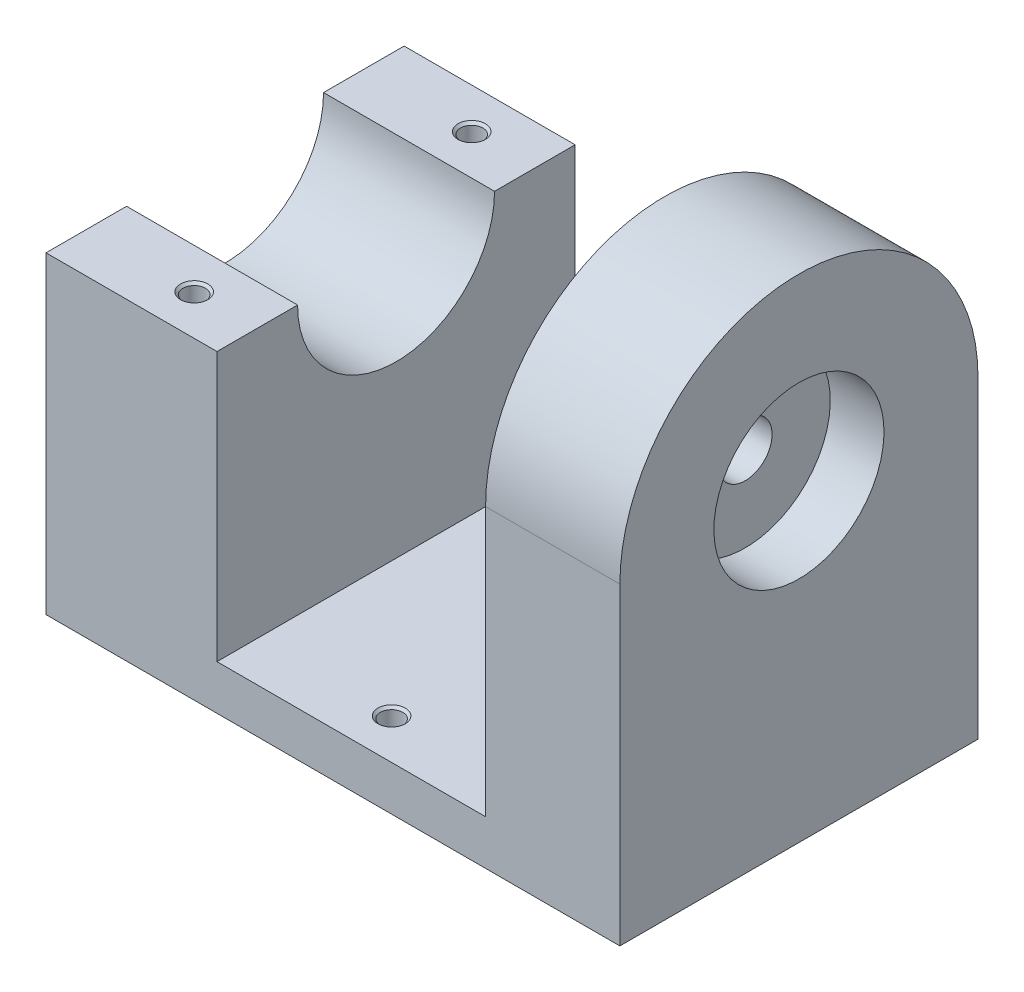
ISO-10303-21;
HEADER;
FILE_DESCRIPTION(('STEP AP214'),'2;1');
FILE_NAME('part.step','',(''),(''),'','','');
FILE_SCHEMA(('AUTOMOTIVE_DESIGN { 1 0 10303 214 1 1 1 1 }'));
ENDSEC;
DATA;
#1=APPLICATION_CONTEXT('core data for automotive mechanical design processes');
#2=APPLICATION_PROTOCOL_DEFINITION('international standard','automotive_design',2000,#1);
#3=PRODUCT_CONTEXT('',#1,'mechanical');
#4=PRODUCT('Part','Part','',(#3));
#5=PRODUCT_RELATED_PRODUCT_CATEGORY('part','',(#4));
#6=PRODUCT_DEFINITION_FORMATION('','',#4);
#7=PRODUCT_DEFINITION_CONTEXT('part definition',#1,'design');
#8=PRODUCT_DEFINITION('design','',#6,#7);
#9=PRODUCT_DEFINITION_SHAPE('','',#8);
#10=(LENGTH_UNIT() NAMED_UNIT(*) SI_UNIT(.MILLI.,.METRE.));
#11=(NAMED_UNIT(*) PLANE_ANGLE_UNIT() SI_UNIT($,.RADIAN.));
#12=(NAMED_UNIT(*) SI_UNIT($,.STERADIAN.) SOLID_ANGLE_UNIT());
#13=UNCERTAINTY_MEASURE_WITH_UNIT(LENGTH_MEASURE(1.E-05),#10,'distance_accuracy_value','');
#14=(GEOMETRIC_REPRESENTATION_CONTEXT(3) GLOBAL_UNCERTAINTY_ASSIGNED_CONTEXT((#13)) GLOBAL_UNIT_ASSIGNED_CONTEXT((#10,
#11,#12)) REPRESENTATION_CONTEXT('',''));
#15=CARTESIAN_POINT('',(0.,0.,0.));
#16=DIRECTION('',(0.,0.,1.));
#17=DIRECTION('',(1.,0.,0.));
#18=AXIS2_PLACEMENT_3D('',#15,#16,#17);
#19=CARTESIAN_POINT('',(-32.05,35.,40.));
#20=DIRECTION('',(0.,-1.,0.));
#21=DIRECTION('',(0.,0.,-1.));
#22=AXIS2_PLACEMENT_3D('',#19,#20,#21);
#23=PLANE('',#22);
#24=CARTESIAN_POINT('',(-20.,35.,35.5));
#25=DIRECTION('',(0.,1.,0.));
#26=DIRECTION('',(0.,0.,1.));
#27=AXIS2_PLACEMENT_3D('',#24,#25,#26);
#28=CIRCLE('',#27,1.525);
#29=CARTESIAN_POINT('',(-20.,35.,37.025));
#30=VERTEX_POINT('',#29);
#31=EDGE_CURVE('E259',#30,#30,#28,.T.);
#32=ORIENTED_EDGE('',*,*,#31,.F.);
#33=EDGE_LOOP('',(#32));
#34=FACE_BOUND('',#33,.T.);
#35=DIRECTION('',(0.,0.,-1.));
#36=VECTOR('',#35,1.);
#37=CARTESIAN_POINT('',(-12.95,35.,40.));
#38=LINE('',#37,#36);
#39=CARTESIAN_POINT('',(-12.95,35.,40.));
#40=VERTEX_POINT('',#39);
#41=CARTESIAN_POINT('',(-12.95,35.,31.));
#42=VERTEX_POINT('',#41);
#43=EDGE_CURVE('E171',#40,#42,#38,.T.);
#44=ORIENTED_EDGE('',*,*,#43,.T.);
#45=DIRECTION('',(-1.,0.,0.));
#46=VECTOR('',#45,1.);
#47=CARTESIAN_POINT('',(-2.05,35.,31.));
#48=LINE('',#47,#46);
#49=CARTESIAN_POINT('',(-32.05,35.,31.));
#50=VERTEX_POINT('',#49);
#51=EDGE_CURVE('E138',#42,#50,#48,.T.);
#52=ORIENTED_EDGE('',*,*,#51,.T.);
#53=DIRECTION('',(0.,0.,-1.));
#54=VECTOR('',#53,1.);
#55=CARTESIAN_POINT('',(-32.05,35.,40.));
#56=LINE('',#55,#54);
#57=CARTESIAN_POINT('',(-32.05,35.,40.));
#58=VERTEX_POINT('',#57);
#59=EDGE_CURVE('E135',#58,#50,#56,.T.);
#60=ORIENTED_EDGE('',*,*,#59,.F.);
#61=DIRECTION('',(-1.,0.,0.));
#62=VECTOR('',#61,1.);
#63=CARTESIAN_POINT('',(-32.05,35.,40.));
#64=LINE('',#63,#62);
#65=EDGE_CURVE('E121',#40,#58,#64,.T.);
#66=ORIENTED_EDGE('',*,*,#65,.F.);
#67=EDGE_LOOP('',(#44,#52,#60,#66));
#68=FACE_BOUND('',#67,.T.);
#69=ADVANCED_FACE('F44',(#34,#68),#23,.F.);
#70=CARTESIAN_POINT('',(32.05,0.,40.));
#71=DIRECTION('',(-1.,0.,0.));
#72=DIRECTION('',(0.,0.,1.));
#73=AXIS2_PLACEMENT_3D('',#70,#71,#72);
#74=PLANE('',#73);
#75=CARTESIAN_POINT('',(32.05,35.,20.));
#76=DIRECTION('',(1.,0.,0.));
#77=DIRECTION('',(0.,1.,0.));
#78=AXIS2_PLACEMENT_3D('',#75,#76,#77);
#79=CIRCLE('',#78,9.5);
#80=CARTESIAN_POINT('',(32.05,44.5,20.));
#81=VERTEX_POINT('',#80);
#82=EDGE_CURVE('E180',#81,#81,#79,.T.);
#83=ORIENTED_EDGE('',*,*,#82,.F.);
#84=EDGE_LOOP('',(#83));
#85=FACE_BOUND('',#84,.T.);
#86=DIRECTION('',(0.,1.,0.));
#87=VECTOR('',#86,1.);
#88=CARTESIAN_POINT('',(32.05,0.,0.));
#89=LINE('',#88,#87);
#90=CARTESIAN_POINT('',(32.05,0.,0.));
#91=VERTEX_POINT('',#90);
#92=CARTESIAN_POINT('',(32.05,35.,0.));
#93=VERTEX_POINT('',#92);
#94=EDGE_CURVE('E150',#91,#93,#89,.T.);
#95=ORIENTED_EDGE('',*,*,#94,.T.);
#96=CARTESIAN_POINT('',(32.05,35.,20.));
#97=DIRECTION('',(1.,0.,0.));
#98=DIRECTION('',(0.,1.,0.));
#99=AXIS2_PLACEMENT_3D('',#96,#97,#98);
#100=CIRCLE('',#99,20.);
#101=CARTESIAN_POINT('',(32.05,35.,40.));
#102=VERTEX_POINT('',#101);
#103=EDGE_CURVE('E207',#93,#102,#100,.T.);
#104=ORIENTED_EDGE('',*,*,#103,.T.);
#105=DIRECTION('',(0.,1.,0.));
#106=VECTOR('',#105,1.);
#107=CARTESIAN_POINT('',(32.05,0.,40.));
#108=LINE('',#107,#106);
#109=CARTESIAN_POINT('',(32.05,0.,40.));
#110=VERTEX_POINT('',#109);
#111=EDGE_CURVE('E105',#110,#102,#108,.T.);
#112=ORIENTED_EDGE('',*,*,#111,.F.);
#113=DIRECTION('',(0.,0.,-1.));
#114=VECTOR('',#113,1.);
#115=CARTESIAN_POINT('',(32.05,0.,40.));
#116=LINE('',#115,#114);
#117=EDGE_CURVE('E146',#110,#91,#116,.T.);
#118=ORIENTED_EDGE('',*,*,#117,.T.);
#119=EDGE_LOOP('',(#95,#104,#112,#118));
#120=FACE_BOUND('',#119,.T.);
#121=ADVANCED_FACE('F46',(#85,#120),#74,.F.);
#122=CARTESIAN_POINT('',(17.05,35.,40.));
#123=DIRECTION('',(1.,0.,0.));
#124=DIRECTION('',(0.,1.,0.));
#125=AXIS2_PLACEMENT_3D('',#122,#123,#124);
#126=PLANE('',#125);
#127=CARTESIAN_POINT('',(17.05,35.,20.));
#128=DIRECTION('',(-1.,0.,0.));
#129=DIRECTION('',(0.,-1.,0.));
#130=AXIS2_PLACEMENT_3D('',#127,#128,#129);
#131=CIRCLE('',#130,9.5);
#132=CARTESIAN_POINT('',(17.05,25.5,20.));
#133=VERTEX_POINT('',#132);
#134=EDGE_CURVE('E201',#133,#133,#131,.T.);
#135=ORIENTED_EDGE('',*,*,#134,.F.);
#136=EDGE_LOOP('',(#135));
#137=FACE_BOUND('',#136,.T.);
#138=DIRECTION('',(0.,-1.,0.));
#139=VECTOR('',#138,1.);
#140=CARTESIAN_POINT('',(17.05,35.,40.));
#141=LINE('',#140,#139);
#142=CARTESIAN_POINT('',(17.05,35.,40.));
#143=VERTEX_POINT('',#142);
#144=CARTESIAN_POINT('',(17.05,5.,40.));
#145=VERTEX_POINT('',#144);
#146=EDGE_CURVE('E223',#143,#145,#141,.T.);
#147=ORIENTED_EDGE('',*,*,#146,.F.);
#148=CARTESIAN_POINT('',(17.05,35.,20.));
#149=DIRECTION('',(1.,0.,0.));
#150=DIRECTION('',(0.,1.,0.));
#151=AXIS2_PLACEMENT_3D('',#148,#149,#150);
#152=CIRCLE('',#151,20.);
#153=CARTESIAN_POINT('',(17.05,35.,0.));
#154=VERTEX_POINT('',#153);
#155=EDGE_CURVE('E210',#154,#143,#152,.T.);
#156=ORIENTED_EDGE('',*,*,#155,.F.);
#157=DIRECTION('',(0.,-1.,0.));
#158=VECTOR('',#157,1.);
#159=CARTESIAN_POINT('',(17.05,35.,0.));
#160=LINE('',#159,#158);
#161=CARTESIAN_POINT('',(17.05,5.,0.));
#162=VERTEX_POINT('',#161);
#163=EDGE_CURVE('E156',#154,#162,#160,.T.);
#164=ORIENTED_EDGE('',*,*,#163,.T.);
#165=DIRECTION('',(0.,0.,-1.));
#166=VECTOR('',#165,1.);
#167=CARTESIAN_POINT('',(17.05,5.,40.));
#168=LINE('',#167,#166);
#169=EDGE_CURVE('E53',#145,#162,#168,.T.);
#170=ORIENTED_EDGE('',*,*,#169,.F.);
#171=EDGE_LOOP('',(#147,#156,#164,#170));
#172=FACE_BOUND('',#171,.T.);
#173=ADVANCED_FACE('F311',(#137,#172),#126,.F.);
#174=CARTESIAN_POINT('',(17.05,5.,40.));
#175=DIRECTION('',(0.,-1.,0.));
#176=DIRECTION('',(1.,0.,0.));
#177=AXIS2_PLACEMENT_3D('',#174,#175,#176);
#178=PLANE('',#177);
#179=CARTESIAN_POINT('',(2.05,5.00000000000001,4.5));
#180=DIRECTION('',(0.,1.,0.));
#181=DIRECTION('',(0.,0.,1.));
#182=AXIS2_PLACEMENT_3D('',#179,#180,#181);
#183=CIRCLE('',#182,1.525);
#184=CARTESIAN_POINT('',(2.05,5.00000000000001,6.025));
#185=VERTEX_POINT('',#184);
#186=EDGE_CURVE('E275',#185,#185,#183,.T.);
#187=ORIENTED_EDGE('',*,*,#186,.F.);
#188=EDGE_LOOP('',(#187));
#189=FACE_BOUND('',#188,.T.);
#190=CARTESIAN_POINT('',(2.05,5.00000000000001,35.5));
#191=DIRECTION('',(0.,1.,0.));
#192=DIRECTION('',(0.,0.,1.));
#193=AXIS2_PLACEMENT_3D('',#190,#191,#192);
#194=CIRCLE('',#193,1.525);
#195=CARTESIAN_POINT('',(2.05,5.00000000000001,37.025));
#196=VERTEX_POINT('',#195);
#197=EDGE_CURVE('E190',#196,#196,#194,.T.);
#198=ORIENTED_EDGE('',*,*,#197,.F.);
#199=EDGE_LOOP('',(#198));
#200=FACE_BOUND('',#199,.T.);
#201=DIRECTION('',(-1.,0.,0.));
#202=VECTOR('',#201,1.);
#203=CARTESIAN_POINT('',(17.05,5.,0.));
#204=LINE('',#203,#202);
#205=CARTESIAN_POINT('',(-12.95,5.00000000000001,0.));
#206=VERTEX_POINT('',#205);
#207=EDGE_CURVE('E158',#162,#206,#204,.T.);
#208=ORIENTED_EDGE('',*,*,#207,.T.);
#209=DIRECTION('',(0.,0.,-1.));
#210=VECTOR('',#209,1.);
#211=CARTESIAN_POINT('',(-12.95,5.00000000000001,40.));
#212=LINE('',#211,#210);
#213=CARTESIAN_POINT('',(-12.95,5.00000000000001,40.));
#214=VERTEX_POINT('',#213);
#215=EDGE_CURVE('E173',#214,#206,#212,.T.);
#216=ORIENTED_EDGE('',*,*,#215,.F.);
#217=DIRECTION('',(-1.,0.,0.));
#218=VECTOR('',#217,1.);
#219=CARTESIAN_POINT('',(17.05,5.,40.));
#220=LINE('',#219,#218);
#221=EDGE_CURVE('E225',#145,#214,#220,.T.);
#222=ORIENTED_EDGE('',*,*,#221,.F.);
#223=ORIENTED_EDGE('',*,*,#169,.T.);
#224=EDGE_LOOP('',(#208,#216,#222,#223));
#225=FACE_BOUND('',#224,.T.);
#226=ADVANCED_FACE('F231',(#189,#200,#225),#178,.F.);
#227=CARTESIAN_POINT('',(-12.95,35.,40.));
#228=DIRECTION('',(-1.,0.,0.));
#229=DIRECTION('',(0.,-1.,0.));
#230=AXIS2_PLACEMENT_3D('',#227,#228,#229);
#231=PLANE('',#230);
#232=CARTESIAN_POINT('',(-12.95,35.,9.));
#233=VERTEX_POINT('',#232);
#234=CARTESIAN_POINT('',(-12.95,35.,0.));
#235=VERTEX_POINT('',#234);
#236=EDGE_CURVE('E140',#233,#235,#38,.T.);
#237=ORIENTED_EDGE('',*,*,#236,.F.);
#238=CARTESIAN_POINT('',(-12.95,35.,20.));
#239=DIRECTION('',(-1.,0.,0.));
#240=DIRECTION('',(0.,-1.,0.));
#241=AXIS2_PLACEMENT_3D('',#238,#239,#240);
#242=CIRCLE('',#241,11.);
#243=EDGE_CURVE('E216',#233,#42,#242,.T.);
#244=ORIENTED_EDGE('',*,*,#243,.T.);
#245=ORIENTED_EDGE('',*,*,#43,.F.);
#246=DIRECTION('',(0.,1.,0.));
#247=VECTOR('',#246,1.);
#248=CARTESIAN_POINT('',(-12.95,35.,40.));
#249=LINE('',#248,#247);
#250=EDGE_CURVE('E128',#214,#40,#249,.T.);
#251=ORIENTED_EDGE('',*,*,#250,.F.);
#252=ORIENTED_EDGE('',*,*,#215,.T.);
#253=DIRECTION('',(0.,1.,0.));
#254=VECTOR('',#253,1.);
#255=CARTESIAN_POINT('',(-12.95,35.,0.));
#256=LINE('',#255,#254);
#257=EDGE_CURVE('E160',#206,#235,#256,.T.);
#258=ORIENTED_EDGE('',*,*,#257,.T.);
#259=EDGE_LOOP('',(#237,#244,#245,#251,#252,#258));
#260=FACE_BOUND('',#259,.T.);
#261=ADVANCED_FACE('F236',(#260),#231,.F.);
#262=CARTESIAN_POINT('',(-20.,35.,4.5));
#263=DIRECTION('',(0.,1.,0.));
#264=DIRECTION('',(0.,0.,1.));
#265=AXIS2_PLACEMENT_3D('',#262,#263,#264);
#266=CIRCLE('',#265,1.525);
#267=CARTESIAN_POINT('',(-20.,35.,6.025));
#268=VERTEX_POINT('',#267);
#269=EDGE_CURVE('E266',#268,#268,#266,.T.);
#270=ORIENTED_EDGE('',*,*,#269,.F.);
#271=EDGE_LOOP('',(#270));
#272=FACE_BOUND('',#271,.T.);
#273=CARTESIAN_POINT('',(-32.05,35.,9.));
#274=VERTEX_POINT('',#273);
#275=CARTESIAN_POINT('',(-32.05,35.,0.));
#276=VERTEX_POINT('',#275);
#277=EDGE_CURVE('E141',#274,#276,#56,.T.);
#278=ORIENTED_EDGE('',*,*,#277,.F.);
#279=DIRECTION('',(-1.,0.,0.));
#280=VECTOR('',#279,1.);
#281=CARTESIAN_POINT('',(-2.05,35.,9.));
#282=LINE('',#281,#280);
#283=EDGE_CURVE('E61',#274,#233,#282,.F.);
#284=ORIENTED_EDGE('',*,*,#283,.T.);
#285=ORIENTED_EDGE('',*,*,#236,.T.);
#286=DIRECTION('',(-1.,0.,0.));
#287=VECTOR('',#286,1.);
#288=CARTESIAN_POINT('',(-32.05,35.,0.));
#289=LINE('',#288,#287);
#290=EDGE_CURVE('E163',#235,#276,#289,.T.);
#291=ORIENTED_EDGE('',*,*,#290,.T.);
#292=EDGE_LOOP('',(#278,#284,#285,#291));
#293=FACE_BOUND('',#292,.T.);
#294=ADVANCED_FACE('F306',(#272,#293),#23,.F.);
#295=CARTESIAN_POINT('',(-32.05,0.,40.));
#296=DIRECTION('',(1.,0.,0.));
#297=DIRECTION('',(0.,1.,0.));
#298=AXIS2_PLACEMENT_3D('',#295,#296,#297);
#299=PLANE('',#298);
#300=ORIENTED_EDGE('',*,*,#59,.T.);
#301=CARTESIAN_POINT('',(-32.05,35.,20.));
#302=DIRECTION('',(1.,0.,0.));
#303=DIRECTION('',(0.,1.,0.));
#304=AXIS2_PLACEMENT_3D('',#301,#302,#303);
#305=CIRCLE('',#304,11.);
#306=EDGE_CURVE('E11',#50,#274,#305,.T.);
#307=ORIENTED_EDGE('',*,*,#306,.T.);
#308=ORIENTED_EDGE('',*,*,#277,.T.);
#309=DIRECTION('',(0.,-1.,0.));
#310=VECTOR('',#309,1.);
#311=CARTESIAN_POINT('',(-32.05,0.,0.));
#312=LINE('',#311,#310);
#313=CARTESIAN_POINT('',(-32.05,0.,0.));
#314=VERTEX_POINT('',#313);
#315=EDGE_CURVE('E166',#276,#314,#312,.T.);
#316=ORIENTED_EDGE('',*,*,#315,.T.);
#317=DIRECTION('',(0.,0.,-1.));
#318=VECTOR('',#317,1.);
#319=CARTESIAN_POINT('',(-32.05,0.,40.));
#320=LINE('',#319,#318);
#321=CARTESIAN_POINT('',(-32.05,0.,40.));
#322=VERTEX_POINT('',#321);
#323=EDGE_CURVE('E144',#322,#314,#320,.T.);
#324=ORIENTED_EDGE('',*,*,#323,.F.);
#325=DIRECTION('',(0.,-1.,0.));
#326=VECTOR('',#325,1.);
#327=CARTESIAN_POINT('',(-32.05,0.,40.));
#328=LINE('',#327,#326);
#329=EDGE_CURVE('E125',#58,#322,#328,.T.);
#330=ORIENTED_EDGE('',*,*,#329,.F.);
#331=EDGE_LOOP('',(#300,#307,#308,#316,#324,#330));
#332=FACE_BOUND('',#331,.T.);
#333=ADVANCED_FACE('F143',(#332),#299,.F.);
#334=CARTESIAN_POINT('',(-32.05,0.,40.));
#335=DIRECTION('',(0.,1.,0.));
#336=DIRECTION('',(-1.,0.,0.));
#337=AXIS2_PLACEMENT_3D('',#334,#335,#336);
#338=PLANE('',#337);
#339=CARTESIAN_POINT('',(2.05,0.,4.5));
#340=DIRECTION('',(0.,1.,0.));
#341=DIRECTION('',(-1.,0.,0.));
#342=AXIS2_PLACEMENT_3D('',#339,#340,#341);
#343=CIRCLE('',#342,1.24999999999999);
#344=CARTESIAN_POINT('',(0.800000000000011,0.,4.5));
#345=VERTEX_POINT('',#344);
#346=EDGE_CURVE('E48',#345,#345,#343,.T.);
#347=ORIENTED_EDGE('',*,*,#346,.T.);
#348=EDGE_LOOP('',(#347));
#349=FACE_BOUND('',#348,.T.);
#350=CARTESIAN_POINT('',(2.05,0.,35.5));
#351=DIRECTION('',(0.,1.,0.));
#352=DIRECTION('',(-1.,0.,0.));
#353=AXIS2_PLACEMENT_3D('',#350,#351,#352);
#354=CIRCLE('',#353,1.24999999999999);
#355=CARTESIAN_POINT('',(0.800000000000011,0.,35.5));
#356=VERTEX_POINT('',#355);
#357=EDGE_CURVE('E182',#356,#356,#354,.T.);
#358=ORIENTED_EDGE('',*,*,#357,.T.);
#359=EDGE_LOOP('',(#358));
#360=FACE_BOUND('',#359,.T.);
#361=DIRECTION('',(1.,0.,0.));
#362=VECTOR('',#361,1.);
#363=CARTESIAN_POINT('',(-32.05,0.,0.));
#364=LINE('',#363,#362);
#365=EDGE_CURVE('E99',#314,#91,#364,.T.);
#366=ORIENTED_EDGE('',*,*,#365,.T.);
#367=ORIENTED_EDGE('',*,*,#117,.F.);
#368=DIRECTION('',(1.,0.,0.));
#369=VECTOR('',#368,1.);
#370=CARTESIAN_POINT('',(-32.05,0.,40.));
#371=LINE('',#370,#369);
#372=EDGE_CURVE('E69',#322,#110,#371,.T.);
#373=ORIENTED_EDGE('',*,*,#372,.F.);
#374=ORIENTED_EDGE('',*,*,#323,.T.);
#375=EDGE_LOOP('',(#366,#367,#373,#374));
#376=FACE_BOUND('',#375,.T.);
#377=ADVANCED_FACE('F284',(#349,#360,#376),#338,.F.);
#378=CARTESIAN_POINT('',(0.,0.,40.));
#379=DIRECTION('',(0.,0.,1.));
#380=DIRECTION('',(1.,0.,0.));
#381=AXIS2_PLACEMENT_3D('',#378,#379,#380);
#382=PLANE('',#381);
#383=ORIENTED_EDGE('',*,*,#111,.T.);
#384=DIRECTION('',(-1.,0.,0.));
#385=VECTOR('',#384,1.);
#386=CARTESIAN_POINT('',(32.05,35.,40.));
#387=LINE('',#386,#385);
#388=EDGE_CURVE('E221',#102,#143,#387,.T.);
#389=ORIENTED_EDGE('',*,*,#388,.T.);
#390=ORIENTED_EDGE('',*,*,#146,.T.);
#391=ORIENTED_EDGE('',*,*,#221,.T.);
#392=ORIENTED_EDGE('',*,*,#250,.T.);
#393=ORIENTED_EDGE('',*,*,#65,.T.);
#394=ORIENTED_EDGE('',*,*,#329,.T.);
#395=ORIENTED_EDGE('',*,*,#372,.T.);
#396=EDGE_LOOP('',(#383,#389,#390,#391,#392,#393,#394,#395));
#397=FACE_BOUND('',#396,.T.);
#398=ADVANCED_FACE('F123',(#397),#382,.T.);
#399=CARTESIAN_POINT('',(0.,0.,0.));
#400=DIRECTION('',(0.,0.,1.));
#401=DIRECTION('',(1.,0.,0.));
#402=AXIS2_PLACEMENT_3D('',#399,#400,#401);
#403=PLANE('',#402);
#404=ORIENTED_EDGE('',*,*,#94,.F.);
#405=ORIENTED_EDGE('',*,*,#365,.F.);
#406=ORIENTED_EDGE('',*,*,#315,.F.);
#407=ORIENTED_EDGE('',*,*,#290,.F.);
#408=ORIENTED_EDGE('',*,*,#257,.F.);
#409=ORIENTED_EDGE('',*,*,#207,.F.);
#410=ORIENTED_EDGE('',*,*,#163,.F.);
#411=DIRECTION('',(-1.,0.,0.));
#412=VECTOR('',#411,1.);
#413=CARTESIAN_POINT('',(32.05,35.,0.));
#414=LINE('',#413,#412);
#415=EDGE_CURVE('E153',#93,#154,#414,.T.);
#416=ORIENTED_EDGE('',*,*,#415,.F.);
#417=EDGE_LOOP('',(#404,#405,#406,#407,#408,#409,#410,#416));
#418=FACE_BOUND('',#417,.T.);
#419=ADVANCED_FACE('F331',(#418),#403,.F.);
#420=CARTESIAN_POINT('',(-2.05,35.,20.));
#421=DIRECTION('',(-1.,0.,0.));
#422=DIRECTION('',(0.,0.,1.));
#423=AXIS2_PLACEMENT_3D('',#420,#421,#422);
#424=CYLINDRICAL_SURFACE('',#423,11.);
#425=ORIENTED_EDGE('',*,*,#243,.F.);
#426=ORIENTED_EDGE('',*,*,#283,.F.);
#427=ORIENTED_EDGE('',*,*,#306,.F.);
#428=ORIENTED_EDGE('',*,*,#51,.F.);
#429=EDGE_LOOP('',(#425,#426,#427,#428));
#430=FACE_BOUND('',#429,.T.);
#431=ADVANCED_FACE('F328',(#430),#424,.F.);
#432=CARTESIAN_POINT('',(17.05,35.,20.));
#433=DIRECTION('',(1.,0.,0.));
#434=DIRECTION('',(0.,1.,0.));
#435=AXIS2_PLACEMENT_3D('',#432,#433,#434);
#436=CYLINDRICAL_SURFACE('',#435,20.);
#437=ORIENTED_EDGE('',*,*,#155,.T.);
#438=ORIENTED_EDGE('',*,*,#388,.F.);
#439=ORIENTED_EDGE('',*,*,#103,.F.);
#440=ORIENTED_EDGE('',*,*,#415,.T.);
#441=EDGE_LOOP('',(#437,#438,#439,#440));
#442=FACE_BOUND('',#441,.T.);
#443=ADVANCED_FACE('F330',(#442),#436,.T.);
#444=CARTESIAN_POINT('',(23.05,35.,20.));
#445=DIRECTION('',(-1.,0.,0.));
#446=DIRECTION('',(0.,-1.,0.));
#447=AXIS2_PLACEMENT_3D('',#444,#445,#446);
#448=CYLINDRICAL_SURFACE('',#447,9.5);
#449=CARTESIAN_POINT('',(23.05,35.,20.));
#450=DIRECTION('',(-1.,0.,0.));
#451=DIRECTION('',(0.,-1.,0.));
#452=AXIS2_PLACEMENT_3D('',#449,#450,#451);
#453=CIRCLE('',#452,9.5);
#454=CARTESIAN_POINT('',(23.05,25.5,20.));
#455=VERTEX_POINT('',#454);
#456=EDGE_CURVE('E204',#455,#455,#453,.T.);
#457=ORIENTED_EDGE('',*,*,#456,.F.);
#458=EDGE_LOOP('',(#457));
#459=FACE_BOUND('',#458,.T.);
#460=ORIENTED_EDGE('',*,*,#134,.T.);
#461=EDGE_LOOP('',(#460));
#462=FACE_BOUND('',#461,.T.);
#463=ADVANCED_FACE('F337',(#459,#462),#448,.F.);
#464=CARTESIAN_POINT('',(23.05,35.,20.));
#465=DIRECTION('',(-1.,0.,0.));
#466=DIRECTION('',(0.,-1.,0.));
#467=AXIS2_PLACEMENT_3D('',#464,#465,#466);
#468=PLANE('',#467);
#469=CARTESIAN_POINT('',(23.05,35.,20.));
#470=DIRECTION('',(-1.,0.,0.));
#471=DIRECTION('',(0.,-1.,0.));
#472=AXIS2_PLACEMENT_3D('',#469,#470,#471);
#473=CIRCLE('',#472,3.);
#474=CARTESIAN_POINT('',(23.05,32.,20.));
#475=VERTEX_POINT('',#474);
#476=EDGE_CURVE('E181',#475,#475,#473,.T.);
#477=ORIENTED_EDGE('',*,*,#476,.F.);
#478=EDGE_LOOP('',(#477));
#479=FACE_BOUND('',#478,.T.);
#480=ORIENTED_EDGE('',*,*,#456,.T.);
#481=EDGE_LOOP('',(#480));
#482=FACE_BOUND('',#481,.T.);
#483=ADVANCED_FACE('F482',(#479,#482),#468,.T.);
#484=CARTESIAN_POINT('',(26.05,35.,20.));
#485=DIRECTION('',(1.,0.,0.));
#486=DIRECTION('',(0.,1.,0.));
#487=AXIS2_PLACEMENT_3D('',#484,#485,#486);
#488=CYLINDRICAL_SURFACE('',#487,9.5);
#489=CARTESIAN_POINT('',(26.05,35.,20.));
#490=DIRECTION('',(1.,0.,0.));
#491=DIRECTION('',(0.,1.,0.));
#492=AXIS2_PLACEMENT_3D('',#489,#490,#491);
#493=CIRCLE('',#492,9.5);
#494=CARTESIAN_POINT('',(26.05,44.5,20.));
#495=VERTEX_POINT('',#494);
#496=EDGE_CURVE('E198',#495,#495,#493,.T.);
#497=ORIENTED_EDGE('',*,*,#496,.F.);
#498=EDGE_LOOP('',(#497));
#499=FACE_BOUND('',#498,.T.);
#500=ORIENTED_EDGE('',*,*,#82,.T.);
#501=EDGE_LOOP('',(#500));
#502=FACE_BOUND('',#501,.T.);
#503=ADVANCED_FACE('F473',(#499,#502),#488,.F.);
#504=CARTESIAN_POINT('',(26.05,35.,20.));
#505=DIRECTION('',(1.,0.,0.));
#506=DIRECTION('',(0.,1.,0.));
#507=AXIS2_PLACEMENT_3D('',#504,#505,#506);
#508=PLANE('',#507);
#509=CARTESIAN_POINT('',(26.05,35.,20.));
#510=DIRECTION('',(1.,0.,0.));
#511=DIRECTION('',(0.,1.,0.));
#512=AXIS2_PLACEMENT_3D('',#509,#510,#511);
#513=CIRCLE('',#512,3.);
#514=CARTESIAN_POINT('',(26.05,38.,20.));
#515=VERTEX_POINT('',#514);
#516=EDGE_CURVE('E178',#515,#515,#513,.T.);
#517=ORIENTED_EDGE('',*,*,#516,.F.);
#518=EDGE_LOOP('',(#517));
#519=FACE_BOUND('',#518,.T.);
#520=ORIENTED_EDGE('',*,*,#496,.T.);
#521=EDGE_LOOP('',(#520));
#522=FACE_BOUND('',#521,.T.);
#523=ADVANCED_FACE('F464',(#519,#522),#508,.T.);
#524=CARTESIAN_POINT('',(42.05,35.,20.));
#525=DIRECTION('',(-1.,0.,0.));
#526=DIRECTION('',(0.,-1.,0.));
#527=AXIS2_PLACEMENT_3D('',#524,#525,#526);
#528=CYLINDRICAL_SURFACE('',#527,3.);
#529=ORIENTED_EDGE('',*,*,#516,.T.);
#530=EDGE_LOOP('',(#529));
#531=FACE_BOUND('',#530,.T.);
#532=ORIENTED_EDGE('',*,*,#476,.T.);
#533=EDGE_LOOP('',(#532));
#534=FACE_BOUND('',#533,.T.);
#535=ADVANCED_FACE('F362',(#531,#534),#528,.F.);
#536=CARTESIAN_POINT('',(2.05,5.,35.5));
#537=DIRECTION('',(0.,1.,0.));
#538=DIRECTION('',(0.,0.,1.));
#539=AXIS2_PLACEMENT_3D('',#536,#537,#538);
#540=CYLINDRICAL_SURFACE('',#539,1.24999999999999);
#541=CARTESIAN_POINT('',(2.05,4.72500000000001,35.5));
#542=DIRECTION('',(0.,1.,0.));
#543=DIRECTION('',(0.,0.,1.));
#544=AXIS2_PLACEMENT_3D('',#541,#542,#543);
#545=CIRCLE('',#544,1.24999999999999);
#546=CARTESIAN_POINT('',(2.05,4.72500000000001,36.75));
#547=VERTEX_POINT('',#546);
#548=EDGE_CURVE('E184',#547,#547,#545,.T.);
#549=ORIENTED_EDGE('',*,*,#548,.T.);
#550=EDGE_LOOP('',(#549));
#551=FACE_BOUND('',#550,.T.);
#552=ORIENTED_EDGE('',*,*,#357,.F.);
#553=EDGE_LOOP('',(#552));
#554=FACE_BOUND('',#553,.T.);
#555=ADVANCED_FACE('F300',(#551,#554),#540,.F.);
#556=CARTESIAN_POINT('',(2.05,5.00000000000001,35.5));
#557=DIRECTION('',(0.,1.,0.));
#558=DIRECTION('',(0.,0.,1.));
#559=AXIS2_PLACEMENT_3D('',#556,#557,#558);
#560=CONICAL_SURFACE('',#559,1.525,0.78539816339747);
#561=ORIENTED_EDGE('',*,*,#548,.F.);
#562=EDGE_LOOP('',(#561));
#563=FACE_BOUND('',#562,.T.);
#564=ORIENTED_EDGE('',*,*,#197,.T.);
#565=EDGE_LOOP('',(#564));
#566=FACE_BOUND('',#565,.T.);
#567=ADVANCED_FACE('F289',(#563,#566),#560,.F.);
#568=CARTESIAN_POINT('',(2.05,5.,4.5));
#569=DIRECTION('',(0.,1.,0.));
#570=DIRECTION('',(0.,0.,1.));
#571=AXIS2_PLACEMENT_3D('',#568,#569,#570);
#572=CYLINDRICAL_SURFACE('',#571,1.24999999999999);
#573=CARTESIAN_POINT('',(2.05,4.72500000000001,4.5));
#574=DIRECTION('',(0.,1.,0.));
#575=DIRECTION('',(0.,0.,1.));
#576=AXIS2_PLACEMENT_3D('',#573,#574,#575);
#577=CIRCLE('',#576,1.24999999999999);
#578=CARTESIAN_POINT('',(2.05,4.72500000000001,5.74999999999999));
#579=VERTEX_POINT('',#578);
#580=EDGE_CURVE('E277',#579,#579,#577,.T.);
#581=ORIENTED_EDGE('',*,*,#580,.T.);
#582=EDGE_LOOP('',(#581));
#583=FACE_BOUND('',#582,.T.);
#584=ORIENTED_EDGE('',*,*,#346,.F.);
#585=EDGE_LOOP('',(#584));
#586=FACE_BOUND('',#585,.T.);
#587=ADVANCED_FACE('F286',(#583,#586),#572,.F.);
#588=CARTESIAN_POINT('',(2.05,5.00000000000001,4.5));
#589=DIRECTION('',(0.,1.,0.));
#590=DIRECTION('',(0.,0.,1.));
#591=AXIS2_PLACEMENT_3D('',#588,#589,#590);
#592=CONICAL_SURFACE('',#591,1.525,0.78539816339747);
#593=ORIENTED_EDGE('',*,*,#580,.F.);
#594=EDGE_LOOP('',(#593));
#595=FACE_BOUND('',#594,.T.);
#596=ORIENTED_EDGE('',*,*,#186,.T.);
#597=EDGE_LOOP('',(#596));
#598=FACE_BOUND('',#597,.T.);
#599=ADVANCED_FACE('F288',(#595,#598),#592,.F.);
#600=CARTESIAN_POINT('',(-20.,29.,35.5));
#601=DIRECTION('',(0.,1.,0.));
#602=DIRECTION('',(0.,0.,1.));
#603=AXIS2_PLACEMENT_3D('',#600,#601,#602);
#604=CONICAL_SURFACE('',#603,1.25,1.02974425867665);
#605=CARTESIAN_POINT('',(-20.,28.2489242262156,35.5));
#606=VERTEX_POINT('',#605);
#607=VERTEX_LOOP('',#606);
#608=FACE_BOUND('',#607,.T.);
#609=CARTESIAN_POINT('',(-20.,29.,35.5));
#610=DIRECTION('',(0.,1.,0.));
#611=DIRECTION('',(0.,0.,1.));
#612=AXIS2_PLACEMENT_3D('',#609,#610,#611);
#613=CIRCLE('',#612,1.25);
#614=CARTESIAN_POINT('',(-20.,29.,36.75));
#615=VERTEX_POINT('',#614);
#616=EDGE_CURVE('E272',#615,#615,#613,.T.);
#617=ORIENTED_EDGE('',*,*,#616,.T.);
#618=EDGE_LOOP('',(#617));
#619=FACE_BOUND('',#618,.T.);
#620=ADVANCED_FACE('F296',(#608,#619),#604,.F.);
#621=CARTESIAN_POINT('',(-20.,35.,35.5));
#622=DIRECTION('',(0.,1.,0.));
#623=DIRECTION('',(0.,0.,1.));
#624=AXIS2_PLACEMENT_3D('',#621,#622,#623);
#625=CYLINDRICAL_SURFACE('',#624,1.25);
#626=ORIENTED_EDGE('',*,*,#616,.F.);
#627=EDGE_LOOP('',(#626));
#628=FACE_BOUND('',#627,.T.);
#629=CARTESIAN_POINT('',(-20.,34.725,35.5));
#630=DIRECTION('',(0.,1.,0.));
#631=DIRECTION('',(0.,0.,1.));
#632=AXIS2_PLACEMENT_3D('',#629,#630,#631);
#633=CIRCLE('',#632,1.25);
#634=CARTESIAN_POINT('',(-20.,34.725,36.75));
#635=VERTEX_POINT('',#634);
#636=EDGE_CURVE('E263',#635,#635,#633,.T.);
#637=ORIENTED_EDGE('',*,*,#636,.T.);
#638=EDGE_LOOP('',(#637));
#639=FACE_BOUND('',#638,.T.);
#640=ADVANCED_FACE('F395',(#628,#639),#625,.F.);
#641=CARTESIAN_POINT('',(-20.,35.,35.5));
#642=DIRECTION('',(0.,1.,0.));
#643=DIRECTION('',(0.,0.,1.));
#644=AXIS2_PLACEMENT_3D('',#641,#642,#643);
#645=CONICAL_SURFACE('',#644,1.525,0.785398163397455);
#646=ORIENTED_EDGE('',*,*,#636,.F.);
#647=EDGE_LOOP('',(#646));
#648=FACE_BOUND('',#647,.T.);
#649=ORIENTED_EDGE('',*,*,#31,.T.);
#650=EDGE_LOOP('',(#649));
#651=FACE_BOUND('',#650,.T.);
#652=ADVANCED_FACE('F253',(#648,#651),#645,.F.);
#653=CARTESIAN_POINT('',(-20.,29.,4.5));
#654=DIRECTION('',(0.,1.,0.));
#655=DIRECTION('',(0.,0.,1.));
#656=AXIS2_PLACEMENT_3D('',#653,#654,#655);
#657=CONICAL_SURFACE('',#656,1.25,1.02974425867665);
#658=CARTESIAN_POINT('',(-20.,28.2489242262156,4.5));
#659=VERTEX_POINT('',#658);
#660=VERTEX_LOOP('',#659);
#661=FACE_BOUND('',#660,.T.);
#662=CARTESIAN_POINT('',(-20.,29.,4.5));
#663=DIRECTION('',(0.,1.,0.));
#664=DIRECTION('',(0.,0.,1.));
#665=AXIS2_PLACEMENT_3D('',#662,#663,#664);
#666=CIRCLE('',#665,1.25);
#667=CARTESIAN_POINT('',(-20.,29.,5.75));
#668=VERTEX_POINT('',#667);
#669=EDGE_CURVE('E257',#668,#668,#666,.T.);
#670=ORIENTED_EDGE('',*,*,#669,.T.);
#671=EDGE_LOOP('',(#670));
#672=FACE_BOUND('',#671,.T.);
#673=ADVANCED_FACE('F249',(#661,#672),#657,.F.);
#674=CARTESIAN_POINT('',(-20.,35.,4.5));
#675=DIRECTION('',(0.,1.,0.));
#676=DIRECTION('',(0.,0.,1.));
#677=AXIS2_PLACEMENT_3D('',#674,#675,#676);
#678=CYLINDRICAL_SURFACE('',#677,1.25);
#679=ORIENTED_EDGE('',*,*,#669,.F.);
#680=EDGE_LOOP('',(#679));
#681=FACE_BOUND('',#680,.T.);
#682=CARTESIAN_POINT('',(-20.,34.725,4.5));
#683=DIRECTION('',(0.,1.,0.));
#684=DIRECTION('',(0.,0.,1.));
#685=AXIS2_PLACEMENT_3D('',#682,#683,#684);
#686=CIRCLE('',#685,1.25);
#687=CARTESIAN_POINT('',(-20.,34.725,5.75));
#688=VERTEX_POINT('',#687);
#689=EDGE_CURVE('E260',#688,#688,#686,.T.);
#690=ORIENTED_EDGE('',*,*,#689,.T.);
#691=EDGE_LOOP('',(#690));
#692=FACE_BOUND('',#691,.T.);
#693=ADVANCED_FACE('F252',(#681,#692),#678,.F.);
#694=CARTESIAN_POINT('',(-20.,35.,4.5));
#695=DIRECTION('',(0.,1.,0.));
#696=DIRECTION('',(0.,0.,1.));
#697=AXIS2_PLACEMENT_3D('',#694,#695,#696);
#698=CONICAL_SURFACE('',#697,1.525,0.785398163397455);
#699=ORIENTED_EDGE('',*,*,#689,.F.);
#700=EDGE_LOOP('',(#699));
#701=FACE_BOUND('',#700,.T.);
#702=ORIENTED_EDGE('',*,*,#269,.T.);
#703=EDGE_LOOP('',(#702));
#704=FACE_BOUND('',#703,.T.);
#705=ADVANCED_FACE('F429',(#701,#704),#698,.F.);
#706=CLOSED_SHELL('',(#69,#121,#173,#226,#261,#294,#333,#377,#398,#419,#431,#443,#463,#483,#503,
#523,#535,#555,#567,#587,#599,#620,#640,#652,#673,#693,#705));
#707=MANIFOLD_SOLID_BREP('B2',#706);
#708=ADVANCED_BREP_SHAPE_REPRESENTATION('',(#18,#707),#14);
#709=SHAPE_DEFINITION_REPRESENTATION(#9,#708);
ENDSEC;
END-ISO-10303-21;
